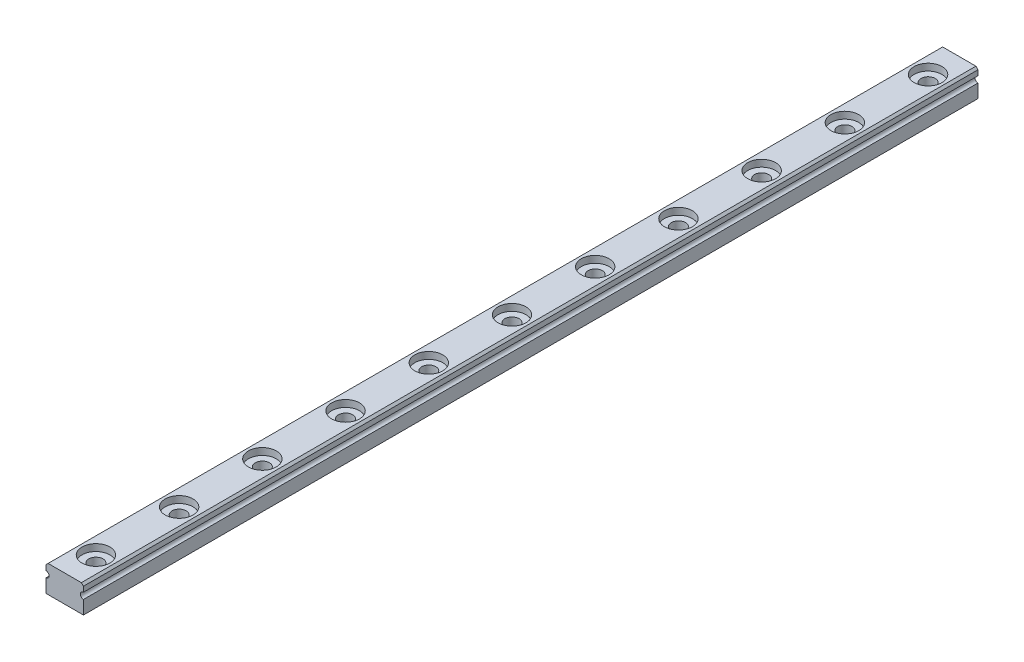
from build123d import *

# Parameters (mm, degrees)
BOSS_EXTRUDE1_DEPTH = 215
SKETCH3_W           = 1.7
SKETCH3_H           = 0.974497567
SKETCH3_H_2         = 4.85
LPATTERN1_COUNT     = 11
LPATTERN1_PITCH     = 20
CHAMFER1_SIZE       = 0.5


with BuildPart() as part:
    # Sketch2 → Boss-Extrude1 (new body)
    with BuildSketch(Plane.XY):
        with BuildLine():
            Line((0, 0), (9, 0))
            Line((9, 0), (9, 3.25))
            ThreePointArc((9, 3.25), (8.25, 4), (9, 4.75))
            Line((9, 4.75), (9, 6.5))
            Line((9, 6.5), (0, 6.5))
            Line((0, 6.5), (0, 4.75))
            ThreePointArc((0, 4.75), (0.75, 4), (0, 3.25))
            Line((0, 3.25), (0, 0))
        make_face()
    extrude(amount=BOSS_EXTRUDE1_DEPTH)

    # Sketch3 → Cut-Revolve1 (revolve, cut)
    with BuildSketch(Plane.XY.offset(207.5), mode=Mode.PRIVATE) as cut_revolve1_sk:
        with Locations((5.35, 5.337248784)):
            Rectangle(SKETCH3_W, SKETCH3_H)
        Polygon((7.85, 6.5), (4.5, 6.5), (4.5, 5.824497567), (6.2, 5.824497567), (6.2, 4.85), (7.85, 4.85), align=None)
        with Locations((5.35, 2.425)):
            Rectangle(SKETCH3_W, SKETCH3_H_2)
    cut_revolve1 = revolve(cut_revolve1_sk.sketch.rotate(Axis((4.5, 6.5, 207.5), (0, -1, 0)), 180), axis=Axis((4.5, 6.5, 207.5), (0, -1, 0)), mode=Mode.SUBTRACT)

    # LPattern1: Cut-Revolve1 ×11
    with Locations(*[(0, 0, -i * LPATTERN1_PITCH) for i in range(1, LPATTERN1_COUNT)]):
        add(cut_revolve1, mode=Mode.SUBTRACT)

    # Chamfer1
    chamfer1_edges = [part.edges().sort_by_distance(p)[0] for p in [
        (0, 6.5, 107.5),
        (9, 6.5, 107.5),
    ]]
    chamfer(chamfer1_edges, length=CHAMFER1_SIZE)


solid = part.part
